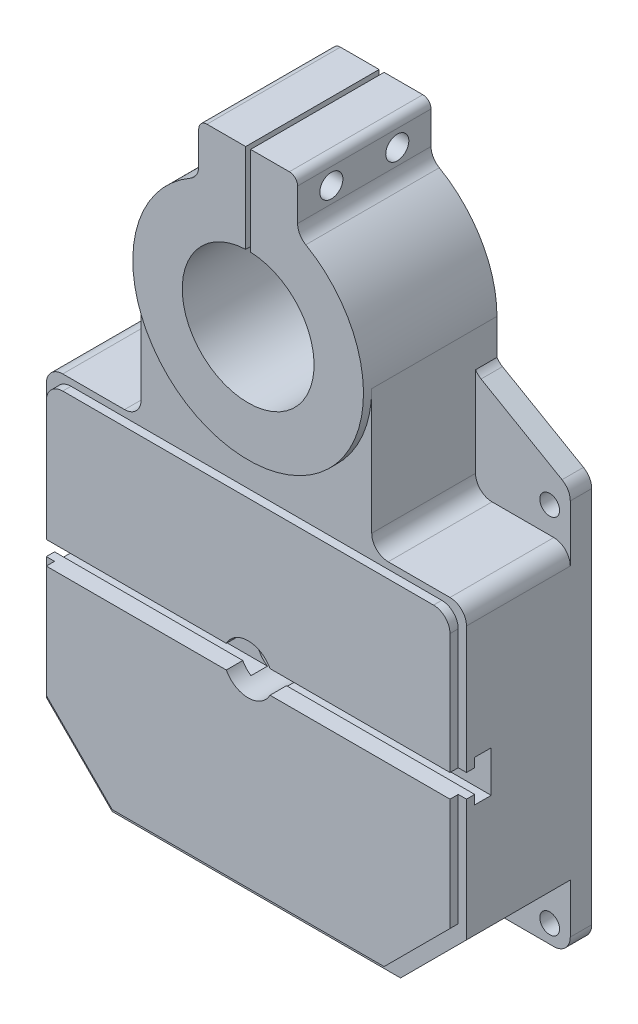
from build123d import *

# Parameters (mm, degrees)
SKETCH_1_R          = 15
SKETCH_1_R_2        = 40
SKETCH_1_R_3        = 6
EXTRUDE_2_DEPTH     = 13
SKETCH_2_R          = 15
SKETCH_2_R_2        = 40
EXTRUDE_3_DEPTH     = 63
EXTRUDE_START       = 13
EXTRUDE_4_DEPTH     = 13
SKETCH_5_R          = 15
SKETCH_5_R_2        = 40
EXTRUDE_5_DEPTH     = 5
CUT_EXTRUDE_1_DEPTH = 58
EXTRUDE_START_2     = 17
SKETCH_7_W          = 231
SKETCH_7_H          = 45
SKETCH_7_R          = 15
EXTRUDE_6_DEPTH     = 17
CUT_EXTRUDE_2_DEPTH = 255
SKETCH_9_W          = 3
SKETCH_9_H          = 110.37407072
CUT_EXTRUDE_3_DEPTH = 70
SKETCH_10_R         = 7
CUT_EXTRUDE_4_DEPTH = 10
CUT_EXTRUDE_5_REACH = 323.548
SKETCH_11_R         = 4.5
SKETCH_12_R         = 11
CUT_EXTRUDE_7_DEPTH = 12
SKETCH_13_R         = 10
SKETCH_13_R_2       = 2.5
CUT_EXTRUDE_8_DEPTH = 12


with BuildPart() as part:
    # Sketch 1 → Extrude 2 (new body)
    with BuildSketch(Plane.XY):
        with BuildLine():
            Line((127.5, 118.226497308), (127.5, -111))
            ThreePointArc((127.5, -111), (124.571067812, -118.071067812), (117.5, -121))
            Line((117.5, -121), (-117.5, -121))
            ThreePointArc((-117.5, -121), (-124.571067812, -118.071067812), (-127.5, -111))
            Line((-127.5, -111), (-127.5, 118.226497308))
            ThreePointArc((-127.5, 118.226497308), (-126.160254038, 123.226497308), (-122.5, 126.886751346))
            Line((-122.5, 126.886751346), (-73.366158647, 155.254187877))
            ThreePointArc((-73.366158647, 155.254187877), (-69.244975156, 159.815172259), (-68.570388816, 165.925136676))
            ThreePointArc((-68.570388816, 165.925136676), (-63.848284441, 208.694887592), (-35, 240.621778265))
            ThreePointArc((-35, 240.621778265), (-31.339745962, 244.282032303), (-30, 249.282032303))
            Line((-30, 249.282032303), (-30, 269))
            ThreePointArc((-30, 269), (-28.535533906, 272.535533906), (-25, 274))
            Line((-25, 274), (0, 274))
            Line((0, 274), (25, 274))
            ThreePointArc((25, 274), (28.535533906, 272.535533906), (30, 269))
            Line((30, 269), (30, 249.282032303))
            ThreePointArc((30, 249.282032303), (31.339745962, 244.282032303), (35, 240.621778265))
            ThreePointArc((35, 240.621778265), (63.848284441, 208.694887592), (68.570388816, 165.925136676))
            ThreePointArc((68.570388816, 165.925136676), (69.244975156, 159.815172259), (73.366158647, 155.254187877))
            Line((73.366158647, 155.254187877), (122.5, 126.886751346))
            ThreePointArc((122.5, 126.886751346), (126.160254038, 123.226497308), (127.5, 118.226497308))
        make_face()
        with Locations(Location((0, 0, 0), (0, 0, 180))):
            Circle(SKETCH_1_R, mode=Mode.SUBTRACT)
        with Locations(Location((0, 180, 0), (0, 0, 180))):
            Circle(SKETCH_1_R_2, mode=Mode.SUBTRACT)
        with Locations(Location((-115, -110, 0), (0, 0, 180))):
            Circle(SKETCH_1_R_3, mode=Mode.SUBTRACT)
        with Locations(Location((-115, 110, 0), (0, 0, 180))):
            Circle(SKETCH_1_R_3, mode=Mode.SUBTRACT)
        with Locations(Location((115, -110, 0), (0, 0, 180))):
            Circle(SKETCH_1_R_3, mode=Mode.SUBTRACT)
        with Locations(Location((115, 110, 0), (0, 0, 180))):
            Circle(SKETCH_1_R_3, mode=Mode.SUBTRACT)
    extrude(amount=EXTRUDE_2_DEPTH)

    # Sketch 2 → Extrude 3 (add)
    with BuildSketch(Plane.XY.offset(13)):
        with BuildLine():
            Line((127.5, -81), (127.5, 84))
            ThreePointArc((127.5, 84), (124.571067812, 91.071067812), (117.5, 94))
            Line((117.5, 94), (80, 94))
            ThreePointArc((80, 94), (72.928932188, 96.928932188), (70, 104))
            Line((70, 104), (70, 180))
            ThreePointArc((70, 180), (60.621778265, 215), (35, 240.621778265))
            ThreePointArc((35, 240.621778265), (31.339745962, 244.282032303), (30, 249.282032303))
            Line((30, 249.282032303), (30, 269))
            ThreePointArc((30, 269), (28.535533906, 272.535533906), (25, 274))
            Line((25, 274), (-25, 274))
            ThreePointArc((-25, 274), (-28.535533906, 272.535533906), (-30, 269))
            Line((-30, 269), (-30, 249.282032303))
            ThreePointArc((-30, 249.282032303), (-31.339745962, 244.282032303), (-35, 240.621778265))
            ThreePointArc((-35, 240.621778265), (-60.621778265, 215), (-70, 180))
            Line((-70, 180), (-70, 104))
            ThreePointArc((-70, 104), (-72.928932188, 96.928932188), (-80, 94))
            Line((-80, 94), (-117.5, 94))
            ThreePointArc((-117.5, 94), (-124.571067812, 91.071067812), (-127.5, 84))
            Line((-127.5, 84), (-127.5, -81))
            Line((-127.5, -81), (-87.5, -121))
            Line((-87.5, -121), (87.5, -121))
            Line((87.5, -121), (127.5, -81))
        make_face()
        with Locations(Location((0, 0, 0), (0, 0, 180))):
            Circle(SKETCH_2_R, mode=Mode.SUBTRACT)
        with Locations(Location((0, 180, 0), (0, 0, 180))):
            Circle(SKETCH_2_R_2, mode=Mode.SUBTRACT)
    extrude(amount=EXTRUDE_3_DEPTH)

    # Sketch 3 → Extrude 4 (add)
    with BuildSketch(Plane(origin=(0, 0, 13), x_dir=(-1, 0, 0), z_dir=(0, 0, -1)).offset(EXTRUDE_START)):
        with BuildLine():
            Line((-70, 180), (-70, 158.436541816))
            ThreePointArc((-70, 158.436541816), (-68.543548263, 162.039255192), (-68.570388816, 165.925136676))
            ThreePointArc((-68.570388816, 165.925136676), (-69.64168011, 172.926359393), (-70, 180))
        make_face()
        with BuildLine():
            Line((70, 158.436541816), (70, 180))
            ThreePointArc((70, 180), (69.64168011, 172.926359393), (68.570388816, 165.925136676))
            ThreePointArc((68.570388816, 165.925136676), (68.543548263, 162.039255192), (70, 158.436541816))
        make_face()
    extrude(amount=-EXTRUDE_4_DEPTH)

    # Sketch 5 → Extrude 5 (add)
    # profile 1 of 2: a face of its own
    with BuildSketch(Plane.XY.offset(76)):
        with BuildLine():
            Line((122.5, 80), (122.5, -75))
            Line((122.5, -75), (82.5, -115))
            Line((82.5, -115), (-82.5, -115))
            Line((-82.5, -115), (-122.5, -75))
            Line((-122.5, -75), (-122.5, 80))
            ThreePointArc((-122.5, 80), (-119.571067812, 87.071067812), (-112.5, 90))
            Line((-112.5, 90), (112.5, 90))
            ThreePointArc((112.5, 90), (119.571067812, 87.071067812), (122.5, 80))
        make_face()
        with Locations(Location((0, 0, 0), (0, 0, 180))):
            Circle(SKETCH_5_R, mode=Mode.SUBTRACT)
    # profile 2 of 2: a face of its own
    with BuildSketch(Plane.XY.offset(76)):
        with BuildLine():
            Line((30, 249.282032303), (30, 269))
            ThreePointArc((30, 269), (28.535533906, 272.535533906), (25, 274))
            Line((25, 274), (-25, 274))
            ThreePointArc((-25, 274), (-28.535533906, 272.535533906), (-30, 269))
            Line((-30, 269), (-30, 249.282032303))
            ThreePointArc((-30, 249.282032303), (-31.339745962, 244.282032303), (-35, 240.621778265))
            ThreePointArc((-35, 240.621778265), (0, 110), (35, 240.621778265))
            ThreePointArc((35, 240.621778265), (31.339745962, 244.282032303), (30, 249.282032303))
        make_face()
        with Locations(Location((0, 180, 0), (0, 0, 180))):
            Circle(SKETCH_5_R_2, mode=Mode.SUBTRACT)
    extrude(amount=EXTRUDE_5_DEPTH)

    # Sketch 6 → Cut-Extrude 1 (cut)
    with BuildSketch(Plane(origin=(0, 0, 0), x_dir=(-1, 0, 0), z_dir=(0, 0, -1))):
        with BuildLine():
            Line((115.5, 72), (115.5, -69))
            Line((115.5, -69), (75.5, -109))
            Line((75.5, -109), (-75.5, -109))
            Line((-75.5, -109), (-115.5, -69))
            Line((-115.5, -69), (-115.5, 72))
            ThreePointArc((-115.5, 72), (-112.571067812, 79.071067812), (-105.5, 82))
            Line((-105.5, 82), (-69, 82))
            ThreePointArc((-69, 82), (-61.928932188, 84.928932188), (-59, 92))
            Line((-59, 92), (-59, 117))
            ThreePointArc((-59, 117), (-56.071067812, 124.071067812), (-49, 127))
            Line((-49, 127), (0, 127))
            Line((0, 127), (49, 127))
            ThreePointArc((49, 127), (56.071067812, 124.071067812), (59, 117))
            Line((59, 117), (59, 92))
            ThreePointArc((59, 92), (61.928932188, 84.928932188), (69, 82))
            Line((69, 82), (105.5, 82))
            ThreePointArc((105.5, 82), (112.571067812, 79.071067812), (115.5, 72))
        make_face()
    extrude(amount=-CUT_EXTRUDE_1_DEPTH, mode=Mode.SUBTRACT)

    # Sketch 7 → Extrude 6 (add)
    with BuildSketch(Plane(origin=(0, 0, 58), x_dir=(-1, 0, 0), z_dir=(0, 0, -1)).offset(EXTRUDE_START_2)):
        Rectangle(SKETCH_7_W, SKETCH_7_H)
        Circle(SKETCH_7_R, mode=Mode.SUBTRACT)
    extrude(amount=-EXTRUDE_6_DEPTH)

    # Sketch 8 → Cut-Extrude 2 (cut)
    with BuildSketch(Plane.ZY.offset(127.5)):
        Polygon((61, 12.5), (61, -12.5), (71, -12.5), (71, -7), (82, -7), (82, 7), (71, 7), (71, 12.5), align=None)
    extrude(amount=-CUT_EXTRUDE_2_DEPTH, mode=Mode.SUBTRACT)

    # Sketch 9 → Cut-Extrude 3 (cut)
    with BuildSketch(Plane(origin=(0, 274, 0), x_dir=(1, 0, 0), z_dir=(0, 1, 0))):
        with Locations((0, -40.5)):
            Rectangle(SKETCH_9_W, SKETCH_9_H)
    extrude(amount=-CUT_EXTRUDE_3_DEPTH, mode=Mode.SUBTRACT)

    # Sketch 10 → Cut-Extrude 4 (cut)
    with BuildSketch(Plane(origin=(30, 0, 0), x_dir=(0, 0, -1), z_dir=(1, 0, 0))):
        with Locations(Location((-60.5, 259, 0), (0, 0, 90))):
            Circle(SKETCH_10_R)
        with Locations(Location((-20.5, 259, 0), (0, 0, 90))):
            Circle(SKETCH_10_R)
    extrude(amount=-CUT_EXTRUDE_4_DEPTH, mode=Mode.SUBTRACT)

    # Cut-Extrude 5: up to this face of the body (flat: up to its plane)
    cut_extrude_5_end = Plane(part.part.faces().sort_by_distance((-30, 259.141016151, 38))[0])
    # Sketch 11 → Cut-Extrude 5 (cut, up to the picked face)
    with BuildSketch(Plane(origin=(20, 0, 0), x_dir=(0, 0, -1), z_dir=(1, 0, 0)), mode=Mode.PRIVATE) as cut_extrude_5_sk1:
        with Locations(Location((-60.5, 259, 0), (0, 0, 90))):
            Circle(SKETCH_11_R)
    cut_extrude_5_tool1 = split(extrude(cut_extrude_5_sk1.sketch, amount=-CUT_EXTRUDE_5_REACH, mode=Mode.PRIVATE), bisect_by=cut_extrude_5_end, keep=Keep.BOTH, mode=Mode.PRIVATE)
    # Sketch 11 → Cut-Extrude 5 (cut, up to the picked face)
    with BuildSketch(Plane(origin=(20, 0, 0), x_dir=(0, 0, -1), z_dir=(1, 0, 0)), mode=Mode.PRIVATE) as cut_extrude_5_sk2:
        with Locations(Location((-20.5, 259, 0), (0, 0, 90))):
            Circle(SKETCH_11_R)
    cut_extrude_5_tool2 = split(extrude(cut_extrude_5_sk2.sketch, amount=-CUT_EXTRUDE_5_REACH, mode=Mode.PRIVATE), bisect_by=cut_extrude_5_end, keep=Keep.BOTH, mode=Mode.PRIVATE)
    add(cut_extrude_5_tool1.solids().sort_by(Axis((20, 259, 60.5), (-1, 0, 0)))[0], mode=Mode.SUBTRACT)
    add(cut_extrude_5_tool2.solids().sort_by(Axis((20, 259, 20.5), (-1, 0, 0)))[0], mode=Mode.SUBTRACT)

    # Sketch 12 → Cut-Extrude 7 (cut)
    with BuildSketch(Plane.ZY.offset(127.5)):
        with Locations((34, 59)):
            Circle(SKETCH_12_R)
    extrude(amount=-CUT_EXTRUDE_7_DEPTH, mode=Mode.SUBTRACT)

    # Sketch 13 → Cut-Extrude 8 (cut)
    with BuildSketch(Plane.XZ.offset(121)):
        with Locations((32, 44.5)):
            Circle(SKETCH_13_R)
        with Locations((-47, 44.5)):
            Circle(SKETCH_13_R_2)
        with Locations((47, 44.5)):
            Circle(SKETCH_13_R_2)
    extrude(amount=-CUT_EXTRUDE_8_DEPTH, mode=Mode.SUBTRACT)


solid = part.part
